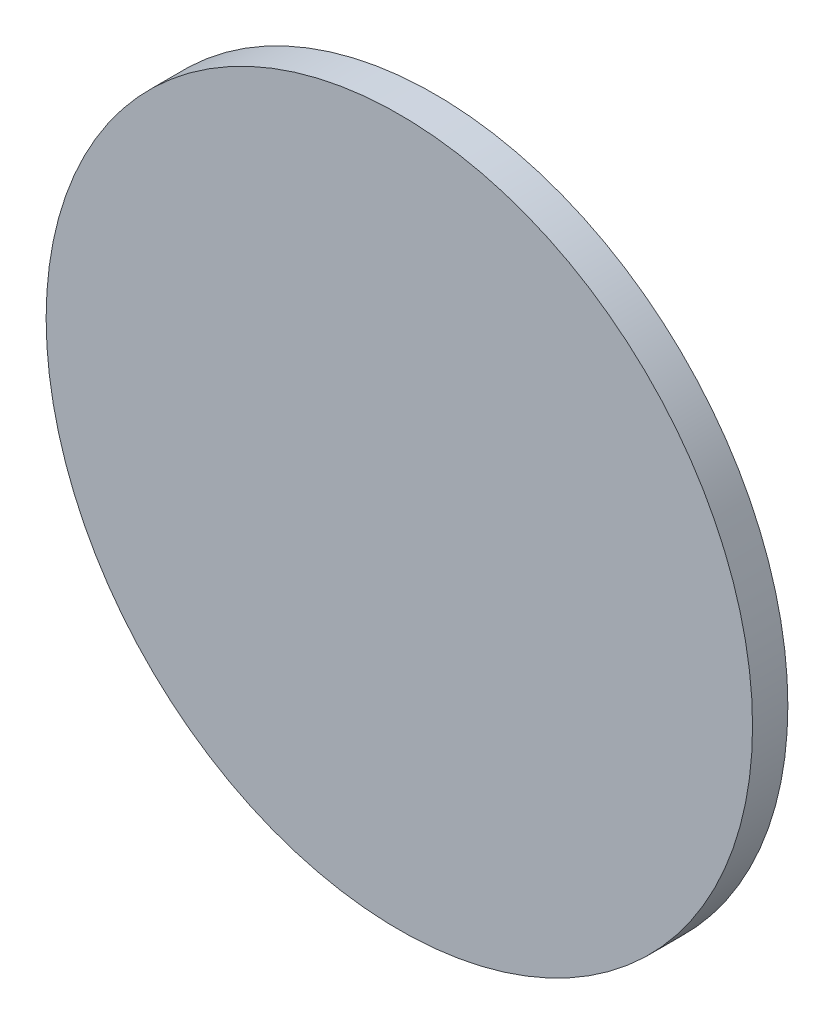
ISO-10303-21;
HEADER;
FILE_DESCRIPTION(('STEP AP214'),'2;1');
FILE_NAME('part.step','',(''),(''),'','','');
FILE_SCHEMA(('AUTOMOTIVE_DESIGN { 1 0 10303 214 1 1 1 1 }'));
ENDSEC;
DATA;
#1=APPLICATION_CONTEXT('core data for automotive mechanical design processes');
#2=APPLICATION_PROTOCOL_DEFINITION('international standard','automotive_design',2000,#1);
#3=PRODUCT_CONTEXT('',#1,'mechanical');
#4=PRODUCT('Part','Part','',(#3));
#5=PRODUCT_RELATED_PRODUCT_CATEGORY('part','',(#4));
#6=PRODUCT_DEFINITION_FORMATION('','',#4);
#7=PRODUCT_DEFINITION_CONTEXT('part definition',#1,'design');
#8=PRODUCT_DEFINITION('design','',#6,#7);
#9=PRODUCT_DEFINITION_SHAPE('','',#8);
#10=(LENGTH_UNIT() NAMED_UNIT(*) SI_UNIT(.MILLI.,.METRE.));
#11=(NAMED_UNIT(*) PLANE_ANGLE_UNIT() SI_UNIT($,.RADIAN.));
#12=(NAMED_UNIT(*) SI_UNIT($,.STERADIAN.) SOLID_ANGLE_UNIT());
#13=UNCERTAINTY_MEASURE_WITH_UNIT(LENGTH_MEASURE(1.E-05),#10,'distance_accuracy_value','');
#14=(GEOMETRIC_REPRESENTATION_CONTEXT(3) GLOBAL_UNCERTAINTY_ASSIGNED_CONTEXT((#13)) GLOBAL_UNIT_ASSIGNED_CONTEXT((#10,
#11,#12)) REPRESENTATION_CONTEXT('',''));
#15=CARTESIAN_POINT('',(0.,0.,0.));
#16=DIRECTION('',(0.,0.,1.));
#17=DIRECTION('',(1.,0.,0.));
#18=AXIS2_PLACEMENT_3D('',#15,#16,#17);
#19=CARTESIAN_POINT('',(2.54,0.,0.254));
#20=DIRECTION('',(0.,0.,-1.));
#21=DIRECTION('',(-1.,0.,0.));
#22=AXIS2_PLACEMENT_3D('',#19,#20,#21);
#23=PLANE('',#22);
#24=CARTESIAN_POINT('',(0.,0.,0.254));
#25=DIRECTION('',(0.,0.,-1.));
#26=DIRECTION('',(-1.,0.,0.));
#27=AXIS2_PLACEMENT_3D('',#24,#25,#26);
#28=CIRCLE('',#27,2.54);
#29=CARTESIAN_POINT('',(-2.54,0.,0.254));
#30=VERTEX_POINT('',#29);
#31=EDGE_CURVE('E18',#30,#30,#28,.T.);
#32=ORIENTED_EDGE('',*,*,#31,.F.);
#33=EDGE_LOOP('',(#32));
#34=FACE_BOUND('',#33,.T.);
#35=ADVANCED_FACE('F15',(#34),#23,.F.);
#36=CARTESIAN_POINT('',(0.,0.,0.));
#37=DIRECTION('',(0.,0.,-1.));
#38=DIRECTION('',(-1.,0.,0.));
#39=AXIS2_PLACEMENT_3D('',#36,#37,#38);
#40=CYLINDRICAL_SURFACE('',#39,2.54);
#41=CARTESIAN_POINT('',(0.,0.,0.));
#42=DIRECTION('',(0.,0.,-1.));
#43=DIRECTION('',(-1.,0.,0.));
#44=AXIS2_PLACEMENT_3D('',#41,#42,#43);
#45=CIRCLE('',#44,2.54);
#46=CARTESIAN_POINT('',(-2.54,0.,0.));
#47=VERTEX_POINT('',#46);
#48=EDGE_CURVE('E10',#47,#47,#45,.T.);
#49=ORIENTED_EDGE('',*,*,#48,.F.);
#50=EDGE_LOOP('',(#49));
#51=FACE_BOUND('',#50,.T.);
#52=ORIENTED_EDGE('',*,*,#31,.T.);
#53=EDGE_LOOP('',(#52));
#54=FACE_BOUND('',#53,.T.);
#55=ADVANCED_FACE('F27',(#51,#54),#40,.T.);
#56=CARTESIAN_POINT('',(2.54,0.,0.));
#57=DIRECTION('',(0.,0.,-1.));
#58=DIRECTION('',(-1.,0.,0.));
#59=AXIS2_PLACEMENT_3D('',#56,#57,#58);
#60=PLANE('',#59);
#61=ORIENTED_EDGE('',*,*,#48,.T.);
#62=EDGE_LOOP('',(#61));
#63=FACE_BOUND('',#62,.T.);
#64=ADVANCED_FACE('F34',(#63),#60,.T.);
#65=CLOSED_SHELL('',(#35,#55,#64));
#66=MANIFOLD_SOLID_BREP('B1',#65);
#67=ADVANCED_BREP_SHAPE_REPRESENTATION('',(#18,#66),#14);
#68=SHAPE_DEFINITION_REPRESENTATION(#9,#67);
ENDSEC;
END-ISO-10303-21;
